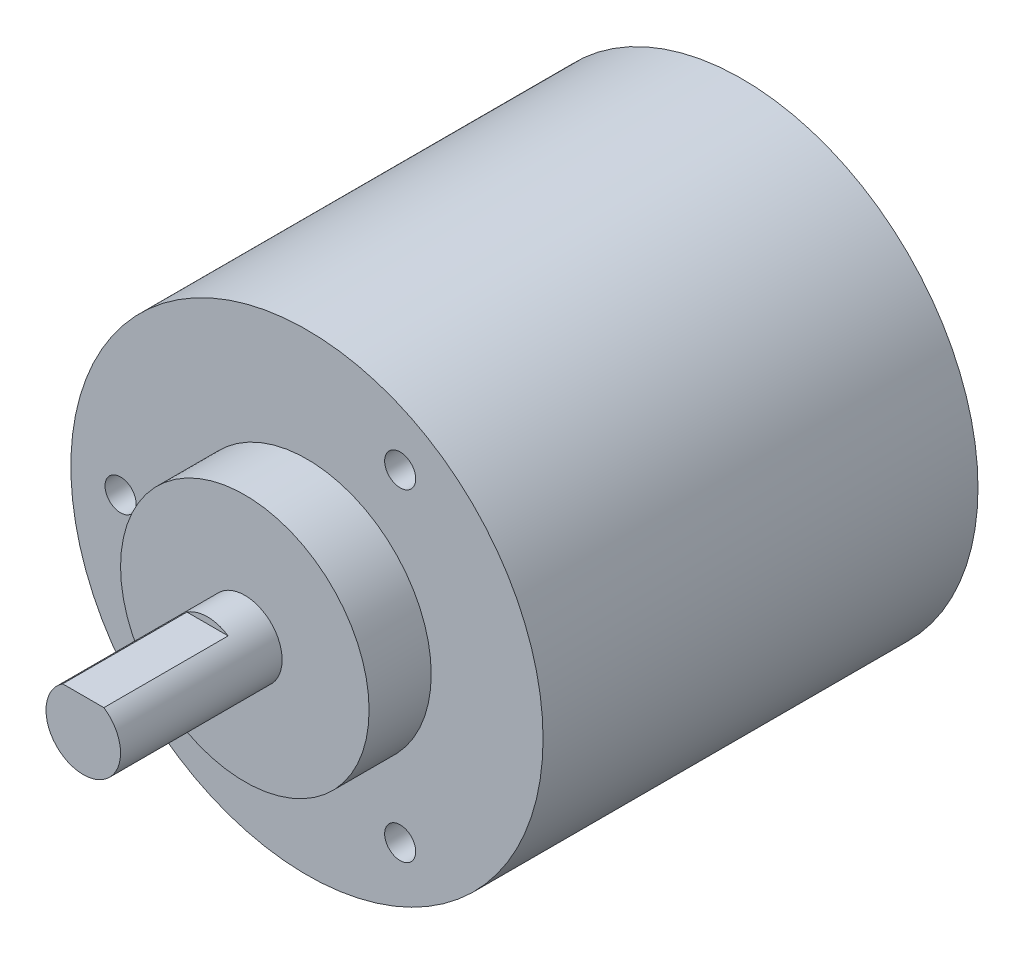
ISO-10303-21;
HEADER;
FILE_DESCRIPTION(('STEP AP214'),'2;1');
FILE_NAME('part.step','',(''),(''),'','','');
FILE_SCHEMA(('AUTOMOTIVE_DESIGN { 1 0 10303 214 1 1 1 1 }'));
ENDSEC;
DATA;
#1=APPLICATION_CONTEXT('core data for automotive mechanical design processes');
#2=APPLICATION_PROTOCOL_DEFINITION('international standard','automotive_design',2000,#1);
#3=PRODUCT_CONTEXT('',#1,'mechanical');
#4=PRODUCT('Part','Part','',(#3));
#5=PRODUCT_RELATED_PRODUCT_CATEGORY('part','',(#4));
#6=PRODUCT_DEFINITION_FORMATION('','',#4);
#7=PRODUCT_DEFINITION_CONTEXT('part definition',#1,'design');
#8=PRODUCT_DEFINITION('design','',#6,#7);
#9=PRODUCT_DEFINITION_SHAPE('','',#8);
#10=(LENGTH_UNIT() NAMED_UNIT(*) SI_UNIT(.MILLI.,.METRE.));
#11=(NAMED_UNIT(*) PLANE_ANGLE_UNIT() SI_UNIT($,.RADIAN.));
#12=(NAMED_UNIT(*) SI_UNIT($,.STERADIAN.) SOLID_ANGLE_UNIT());
#13=UNCERTAINTY_MEASURE_WITH_UNIT(LENGTH_MEASURE(1.E-05),#10,'distance_accuracy_value','');
#14=(GEOMETRIC_REPRESENTATION_CONTEXT(3) GLOBAL_UNCERTAINTY_ASSIGNED_CONTEXT((#13)) GLOBAL_UNIT_ASSIGNED_CONTEXT((#10,
#11,#12)) REPRESENTATION_CONTEXT('',''));
#15=CARTESIAN_POINT('',(0.,0.,0.));
#16=DIRECTION('',(0.,0.,1.));
#17=DIRECTION('',(1.,0.,0.));
#18=AXIS2_PLACEMENT_3D('',#15,#16,#17);
#19=CARTESIAN_POINT('',(0.,0.,35.));
#20=DIRECTION('',(0.,0.,-1.));
#21=DIRECTION('',(-1.,0.,0.));
#22=AXIS2_PLACEMENT_3D('',#19,#20,#21);
#23=CYLINDRICAL_SURFACE('',#22,19.);
#24=CARTESIAN_POINT('',(0.,0.,35.));
#25=DIRECTION('',(0.,0.,1.));
#26=DIRECTION('',(1.,0.,0.));
#27=AXIS2_PLACEMENT_3D('',#24,#25,#26);
#28=CIRCLE('',#27,19.);
#29=CARTESIAN_POINT('',(19.,0.,35.));
#30=VERTEX_POINT('',#29);
#31=EDGE_CURVE('E121',#30,#30,#28,.T.);
#32=ORIENTED_EDGE('',*,*,#31,.F.);
#33=EDGE_LOOP('',(#32));
#34=FACE_BOUND('',#33,.T.);
#35=CARTESIAN_POINT('',(0.,0.,0.));
#36=DIRECTION('',(0.,0.,1.));
#37=DIRECTION('',(1.,0.,0.));
#38=AXIS2_PLACEMENT_3D('',#35,#36,#37);
#39=CIRCLE('',#38,19.);
#40=CARTESIAN_POINT('',(19.,0.,0.));
#41=VERTEX_POINT('',#40);
#42=EDGE_CURVE('E118',#41,#41,#39,.T.);
#43=ORIENTED_EDGE('',*,*,#42,.T.);
#44=EDGE_LOOP('',(#43));
#45=FACE_BOUND('',#44,.T.);
#46=ADVANCED_FACE('F43',(#34,#45),#23,.T.);
#47=CARTESIAN_POINT('',(0.,0.,35.));
#48=DIRECTION('',(0.,0.,1.));
#49=DIRECTION('',(1.,0.,0.));
#50=AXIS2_PLACEMENT_3D('',#47,#48,#49);
#51=PLANE('',#50);
#52=CARTESIAN_POINT('',(7.49999999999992,12.9903810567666,35.));
#53=DIRECTION('',(0.,0.,1.));
#54=DIRECTION('',(1.,0.,0.));
#55=AXIS2_PLACEMENT_3D('',#52,#53,#54);
#56=CIRCLE('',#55,1.24999999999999);
#57=CARTESIAN_POINT('',(8.74999999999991,12.9903810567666,35.));
#58=VERTEX_POINT('',#57);
#59=EDGE_CURVE('E88',#58,#58,#56,.T.);
#60=ORIENTED_EDGE('',*,*,#59,.F.);
#61=EDGE_LOOP('',(#60));
#62=FACE_BOUND('',#61,.T.);
#63=CARTESIAN_POINT('',(7.50000000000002,-12.9903810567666,35.));
#64=DIRECTION('',(0.,0.,1.));
#65=DIRECTION('',(1.,0.,0.));
#66=AXIS2_PLACEMENT_3D('',#63,#64,#65);
#67=CIRCLE('',#66,1.24999999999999);
#68=CARTESIAN_POINT('',(8.75000000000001,-12.9903810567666,35.));
#69=VERTEX_POINT('',#68);
#70=EDGE_CURVE('E87',#69,#69,#67,.T.);
#71=ORIENTED_EDGE('',*,*,#70,.F.);
#72=EDGE_LOOP('',(#71));
#73=FACE_BOUND('',#72,.T.);
#74=CARTESIAN_POINT('',(-15.,0.,35.));
#75=DIRECTION('',(0.,0.,1.));
#76=DIRECTION('',(1.,0.,0.));
#77=AXIS2_PLACEMENT_3D('',#74,#75,#76);
#78=CIRCLE('',#77,1.24999999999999);
#79=CARTESIAN_POINT('',(-13.75,0.,35.));
#80=VERTEX_POINT('',#79);
#81=EDGE_CURVE('E98',#80,#80,#78,.T.);
#82=ORIENTED_EDGE('',*,*,#81,.F.);
#83=EDGE_LOOP('',(#82));
#84=FACE_BOUND('',#83,.T.);
#85=CARTESIAN_POINT('',(0.,0.,35.));
#86=DIRECTION('',(0.,0.,1.));
#87=DIRECTION('',(1.,0.,0.));
#88=AXIS2_PLACEMENT_3D('',#85,#86,#87);
#89=CIRCLE('',#88,10.);
#90=CARTESIAN_POINT('',(10.,0.,35.));
#91=VERTEX_POINT('',#90);
#92=EDGE_CURVE('E115',#91,#91,#89,.T.);
#93=ORIENTED_EDGE('',*,*,#92,.F.);
#94=EDGE_LOOP('',(#93));
#95=FACE_BOUND('',#94,.T.);
#96=ORIENTED_EDGE('',*,*,#31,.T.);
#97=EDGE_LOOP('',(#96));
#98=FACE_BOUND('',#97,.T.);
#99=ADVANCED_FACE('F146',(#62,#73,#84,#95,#98),#51,.T.);
#100=CARTESIAN_POINT('',(0.,0.,0.));
#101=DIRECTION('',(0.,0.,1.));
#102=DIRECTION('',(1.,0.,0.));
#103=AXIS2_PLACEMENT_3D('',#100,#101,#102);
#104=PLANE('',#103);
#105=ORIENTED_EDGE('',*,*,#42,.F.);
#106=EDGE_LOOP('',(#105));
#107=FACE_BOUND('',#106,.T.);
#108=ADVANCED_FACE('F151',(#107),#104,.F.);
#109=CARTESIAN_POINT('',(0.,0.,40.));
#110=DIRECTION('',(0.,0.,-1.));
#111=DIRECTION('',(-1.,0.,0.));
#112=AXIS2_PLACEMENT_3D('',#109,#110,#111);
#113=CYLINDRICAL_SURFACE('',#112,10.);
#114=CARTESIAN_POINT('',(0.,0.,40.));
#115=DIRECTION('',(0.,0.,1.));
#116=DIRECTION('',(1.,0.,0.));
#117=AXIS2_PLACEMENT_3D('',#114,#115,#116);
#118=CIRCLE('',#117,10.);
#119=CARTESIAN_POINT('',(10.,0.,40.));
#120=VERTEX_POINT('',#119);
#121=EDGE_CURVE('E111',#120,#120,#118,.T.);
#122=ORIENTED_EDGE('',*,*,#121,.F.);
#123=EDGE_LOOP('',(#122));
#124=FACE_BOUND('',#123,.T.);
#125=ORIENTED_EDGE('',*,*,#92,.T.);
#126=EDGE_LOOP('',(#125));
#127=FACE_BOUND('',#126,.T.);
#128=ADVANCED_FACE('F159',(#124,#127),#113,.T.);
#129=CARTESIAN_POINT('',(0.,0.,40.));
#130=DIRECTION('',(0.,0.,1.));
#131=DIRECTION('',(1.,0.,0.));
#132=AXIS2_PLACEMENT_3D('',#129,#130,#131);
#133=PLANE('',#132);
#134=CARTESIAN_POINT('',(0.,0.,40.));
#135=DIRECTION('',(0.,0.,1.));
#136=DIRECTION('',(1.,0.,0.));
#137=AXIS2_PLACEMENT_3D('',#134,#135,#136);
#138=CIRCLE('',#137,3.);
#139=CARTESIAN_POINT('',(3.,0.,40.));
#140=VERTEX_POINT('',#139);
#141=EDGE_CURVE('E112',#140,#140,#138,.T.);
#142=ORIENTED_EDGE('',*,*,#141,.F.);
#143=EDGE_LOOP('',(#142));
#144=FACE_BOUND('',#143,.T.);
#145=ORIENTED_EDGE('',*,*,#121,.T.);
#146=EDGE_LOOP('',(#145));
#147=FACE_BOUND('',#146,.T.);
#148=ADVANCED_FACE('F142',(#144,#147),#133,.T.);
#149=CARTESIAN_POINT('',(0.,0.,53.));
#150=DIRECTION('',(0.,0.,-1.));
#151=DIRECTION('',(-1.,0.,0.));
#152=AXIS2_PLACEMENT_3D('',#149,#150,#151);
#153=CYLINDRICAL_SURFACE('',#152,3.);
#154=CARTESIAN_POINT('',(0.,0.,53.));
#155=DIRECTION('',(0.,0.,1.));
#156=DIRECTION('',(1.,0.,0.));
#157=AXIS2_PLACEMENT_3D('',#154,#155,#156);
#158=CIRCLE('',#157,3.);
#159=CARTESIAN_POINT('',(-1.6583123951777,2.5,53.));
#160=VERTEX_POINT('',#159);
#161=CARTESIAN_POINT('',(1.6583123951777,2.5,53.));
#162=VERTEX_POINT('',#161);
#163=EDGE_CURVE('E108',#160,#162,#158,.T.);
#164=ORIENTED_EDGE('',*,*,#163,.F.);
#165=DIRECTION('',(0.,0.,-1.));
#166=VECTOR('',#165,1.);
#167=CARTESIAN_POINT('',(-1.6583123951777,2.5,53.));
#168=LINE('',#167,#166);
#169=CARTESIAN_POINT('',(-1.6583123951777,2.5,43.));
#170=VERTEX_POINT('',#169);
#171=EDGE_CURVE('E57',#160,#170,#168,.T.);
#172=ORIENTED_EDGE('',*,*,#171,.T.);
#173=CARTESIAN_POINT('',(0.,0.,43.));
#174=DIRECTION('',(0.,0.,1.));
#175=DIRECTION('',(1.,0.,0.));
#176=AXIS2_PLACEMENT_3D('',#173,#174,#175);
#177=CIRCLE('',#176,3.);
#178=CARTESIAN_POINT('',(1.6583123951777,2.5,43.));
#179=VERTEX_POINT('',#178);
#180=EDGE_CURVE('E11',#179,#170,#177,.T.);
#181=ORIENTED_EDGE('',*,*,#180,.F.);
#182=DIRECTION('',(0.,0.,-1.));
#183=VECTOR('',#182,1.);
#184=CARTESIAN_POINT('',(1.6583123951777,2.5,53.));
#185=LINE('',#184,#183);
#186=EDGE_CURVE('E62',#179,#162,#185,.F.);
#187=ORIENTED_EDGE('',*,*,#186,.T.);
#188=EDGE_LOOP('',(#164,#172,#181,#187));
#189=FACE_BOUND('',#188,.T.);
#190=ORIENTED_EDGE('',*,*,#141,.T.);
#191=EDGE_LOOP('',(#190));
#192=FACE_BOUND('',#191,.T.);
#193=ADVANCED_FACE('F130',(#189,#192),#153,.T.);
#194=CARTESIAN_POINT('',(0.,0.,53.));
#195=DIRECTION('',(0.,0.,1.));
#196=DIRECTION('',(1.,0.,0.));
#197=AXIS2_PLACEMENT_3D('',#194,#195,#196);
#198=PLANE('',#197);
#199=DIRECTION('',(1.,0.,0.));
#200=VECTOR('',#199,1.);
#201=CARTESIAN_POINT('',(0.,2.5,53.));
#202=LINE('',#201,#200);
#203=EDGE_CURVE('E50',#160,#162,#202,.T.);
#204=ORIENTED_EDGE('',*,*,#203,.F.);
#205=ORIENTED_EDGE('',*,*,#163,.T.);
#206=EDGE_LOOP('',(#204,#205));
#207=FACE_BOUND('',#206,.T.);
#208=ADVANCED_FACE('F132',(#207),#198,.T.);
#209=CARTESIAN_POINT('',(0.,0.,43.));
#210=DIRECTION('',(0.,0.,1.));
#211=DIRECTION('',(1.,0.,0.));
#212=AXIS2_PLACEMENT_3D('',#209,#210,#211);
#213=PLANE('',#212);
#214=ORIENTED_EDGE('',*,*,#180,.T.);
#215=DIRECTION('',(1.,0.,0.));
#216=VECTOR('',#215,1.);
#217=CARTESIAN_POINT('',(-3.,2.5,43.));
#218=LINE('',#217,#216);
#219=EDGE_CURVE('E104',#170,#179,#218,.T.);
#220=ORIENTED_EDGE('',*,*,#219,.T.);
#221=EDGE_LOOP('',(#214,#220));
#222=FACE_BOUND('',#221,.T.);
#223=ADVANCED_FACE('F134',(#222),#213,.T.);
#224=CARTESIAN_POINT('',(-3.,2.5,43.));
#225=DIRECTION('',(0.,-1.,0.));
#226=DIRECTION('',(0.,0.,-1.));
#227=AXIS2_PLACEMENT_3D('',#224,#225,#226);
#228=PLANE('',#227);
#229=ORIENTED_EDGE('',*,*,#203,.T.);
#230=ORIENTED_EDGE('',*,*,#186,.F.);
#231=ORIENTED_EDGE('',*,*,#219,.F.);
#232=ORIENTED_EDGE('',*,*,#171,.F.);
#233=EDGE_LOOP('',(#229,#230,#231,#232));
#234=FACE_BOUND('',#233,.T.);
#235=ADVANCED_FACE('F125',(#234),#228,.F.);
#236=CARTESIAN_POINT('',(-15.,0.,26.5));
#237=DIRECTION('',(0.,0.,1.));
#238=DIRECTION('',(1.,0.,0.));
#239=AXIS2_PLACEMENT_3D('',#236,#237,#238);
#240=CONICAL_SURFACE('',#239,1.25,1.02974425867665);
#241=CARTESIAN_POINT('',(-15.,0.,25.7489242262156));
#242=VERTEX_POINT('',#241);
#243=VERTEX_LOOP('',#242);
#244=FACE_BOUND('',#243,.T.);
#245=CARTESIAN_POINT('',(-15.,0.,26.5));
#246=DIRECTION('',(0.,0.,1.));
#247=DIRECTION('',(1.,0.,0.));
#248=AXIS2_PLACEMENT_3D('',#245,#246,#247);
#249=CIRCLE('',#248,1.25);
#250=CARTESIAN_POINT('',(-13.75,0.,26.5));
#251=VERTEX_POINT('',#250);
#252=EDGE_CURVE('E101',#251,#251,#249,.T.);
#253=ORIENTED_EDGE('',*,*,#252,.T.);
#254=EDGE_LOOP('',(#253));
#255=FACE_BOUND('',#254,.T.);
#256=ADVANCED_FACE('F205',(#244,#255),#240,.F.);
#257=CARTESIAN_POINT('',(-15.,0.,35.));
#258=DIRECTION('',(0.,0.,1.));
#259=DIRECTION('',(1.,0.,0.));
#260=AXIS2_PLACEMENT_3D('',#257,#258,#259);
#261=CYLINDRICAL_SURFACE('',#260,1.24999999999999);
#262=ORIENTED_EDGE('',*,*,#252,.F.);
#263=EDGE_LOOP('',(#262));
#264=FACE_BOUND('',#263,.T.);
#265=ORIENTED_EDGE('',*,*,#81,.T.);
#266=EDGE_LOOP('',(#265));
#267=FACE_BOUND('',#266,.T.);
#268=ADVANCED_FACE('F226',(#264,#267),#261,.F.);
#269=CARTESIAN_POINT('',(7.50000000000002,-12.9903810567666,26.5));
#270=DIRECTION('',(0.,0.,1.));
#271=DIRECTION('',(1.,0.,0.));
#272=AXIS2_PLACEMENT_3D('',#269,#270,#271);
#273=CONICAL_SURFACE('',#272,1.25,1.02974425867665);
#274=CARTESIAN_POINT('',(7.50000000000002,-12.9903810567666,25.7489242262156));
#275=VERTEX_POINT('',#274);
#276=VERTEX_LOOP('',#275);
#277=FACE_BOUND('',#276,.T.);
#278=CARTESIAN_POINT('',(7.50000000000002,-12.9903810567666,26.5));
#279=DIRECTION('',(0.,0.,1.));
#280=DIRECTION('',(1.,0.,0.));
#281=AXIS2_PLACEMENT_3D('',#278,#279,#280);
#282=CIRCLE('',#281,1.25);
#283=CARTESIAN_POINT('',(8.75000000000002,-12.9903810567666,26.5));
#284=VERTEX_POINT('',#283);
#285=EDGE_CURVE('E91',#284,#284,#282,.T.);
#286=ORIENTED_EDGE('',*,*,#285,.T.);
#287=EDGE_LOOP('',(#286));
#288=FACE_BOUND('',#287,.T.);
#289=ADVANCED_FACE('F238',(#277,#288),#273,.F.);
#290=CARTESIAN_POINT('',(7.50000000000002,-12.9903810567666,35.));
#291=DIRECTION('',(0.,0.,1.));
#292=DIRECTION('',(1.,0.,0.));
#293=AXIS2_PLACEMENT_3D('',#290,#291,#292);
#294=CYLINDRICAL_SURFACE('',#293,1.24999999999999);
#295=ORIENTED_EDGE('',*,*,#285,.F.);
#296=EDGE_LOOP('',(#295));
#297=FACE_BOUND('',#296,.T.);
#298=ORIENTED_EDGE('',*,*,#70,.T.);
#299=EDGE_LOOP('',(#298));
#300=FACE_BOUND('',#299,.T.);
#301=ADVANCED_FACE('F81',(#297,#300),#294,.F.);
#302=CARTESIAN_POINT('',(7.49999999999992,12.9903810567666,26.5));
#303=DIRECTION('',(0.,0.,1.));
#304=DIRECTION('',(1.,0.,0.));
#305=AXIS2_PLACEMENT_3D('',#302,#303,#304);
#306=CONICAL_SURFACE('',#305,1.25,1.02974425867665);
#307=CARTESIAN_POINT('',(7.49999999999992,12.9903810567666,25.7489242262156));
#308=VERTEX_POINT('',#307);
#309=VERTEX_LOOP('',#308);
#310=FACE_BOUND('',#309,.T.);
#311=CARTESIAN_POINT('',(7.49999999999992,12.9903810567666,26.5));
#312=DIRECTION('',(0.,0.,1.));
#313=DIRECTION('',(1.,0.,0.));
#314=AXIS2_PLACEMENT_3D('',#311,#312,#313);
#315=CIRCLE('',#314,1.25);
#316=CARTESIAN_POINT('',(8.74999999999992,12.9903810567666,26.5));
#317=VERTEX_POINT('',#316);
#318=EDGE_CURVE('E85',#317,#317,#315,.T.);
#319=ORIENTED_EDGE('',*,*,#318,.T.);
#320=EDGE_LOOP('',(#319));
#321=FACE_BOUND('',#320,.T.);
#322=ADVANCED_FACE('F77',(#310,#321),#306,.F.);
#323=CARTESIAN_POINT('',(7.49999999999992,12.9903810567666,35.));
#324=DIRECTION('',(0.,0.,1.));
#325=DIRECTION('',(1.,0.,0.));
#326=AXIS2_PLACEMENT_3D('',#323,#324,#325);
#327=CYLINDRICAL_SURFACE('',#326,1.24999999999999);
#328=ORIENTED_EDGE('',*,*,#318,.F.);
#329=EDGE_LOOP('',(#328));
#330=FACE_BOUND('',#329,.T.);
#331=ORIENTED_EDGE('',*,*,#59,.T.);
#332=EDGE_LOOP('',(#331));
#333=FACE_BOUND('',#332,.T.);
#334=ADVANCED_FACE('F80',(#330,#333),#327,.F.);
#335=CLOSED_SHELL('',(#46,#99,#108,#128,#148,#193,#208,#223,#235,#256,#268,#289,#301,#322,#334));
#336=MANIFOLD_SOLID_BREP('B2',#335);
#337=ADVANCED_BREP_SHAPE_REPRESENTATION('',(#18,#336),#14);
#338=SHAPE_DEFINITION_REPRESENTATION(#9,#337);
ENDSEC;
END-ISO-10303-21;
